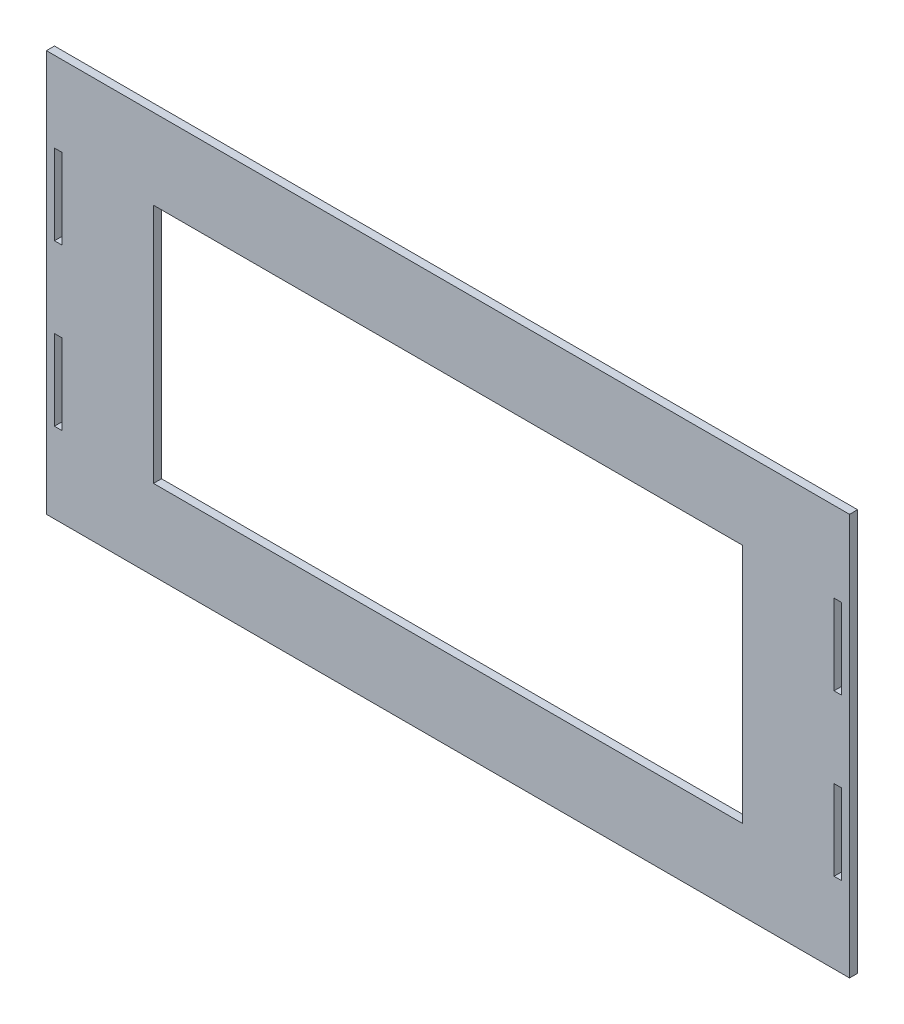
ISO-10303-21;
HEADER;
FILE_DESCRIPTION(('STEP AP214'),'2;1');
FILE_NAME('part.step','',(''),(''),'','','');
FILE_SCHEMA(('AUTOMOTIVE_DESIGN { 1 0 10303 214 1 1 1 1 }'));
ENDSEC;
DATA;
#1=APPLICATION_CONTEXT('core data for automotive mechanical design processes');
#2=APPLICATION_PROTOCOL_DEFINITION('international standard','automotive_design',2000,#1);
#3=PRODUCT_CONTEXT('',#1,'mechanical');
#4=PRODUCT('Part','Part','',(#3));
#5=PRODUCT_RELATED_PRODUCT_CATEGORY('part','',(#4));
#6=PRODUCT_DEFINITION_FORMATION('','',#4);
#7=PRODUCT_DEFINITION_CONTEXT('part definition',#1,'design');
#8=PRODUCT_DEFINITION('design','',#6,#7);
#9=PRODUCT_DEFINITION_SHAPE('','',#8);
#10=(LENGTH_UNIT() NAMED_UNIT(*) SI_UNIT(.MILLI.,.METRE.));
#11=(NAMED_UNIT(*) PLANE_ANGLE_UNIT() SI_UNIT($,.RADIAN.));
#12=(NAMED_UNIT(*) SI_UNIT($,.STERADIAN.) SOLID_ANGLE_UNIT());
#13=UNCERTAINTY_MEASURE_WITH_UNIT(LENGTH_MEASURE(1.E-05),#10,'distance_accuracy_value','');
#14=(GEOMETRIC_REPRESENTATION_CONTEXT(3) GLOBAL_UNCERTAINTY_ASSIGNED_CONTEXT((#13)) GLOBAL_UNIT_ASSIGNED_CONTEXT((#10,
#11,#12)) REPRESENTATION_CONTEXT('',''));
#15=CARTESIAN_POINT('',(0.,0.,0.));
#16=DIRECTION('',(0.,0.,1.));
#17=DIRECTION('',(1.,0.,0.));
#18=AXIS2_PLACEMENT_3D('',#15,#16,#17);
#19=CARTESIAN_POINT('',(0.,0.,3.));
#20=DIRECTION('',(0.,0.,-1.));
#21=DIRECTION('',(-1.,0.,0.));
#22=AXIS2_PLACEMENT_3D('',#19,#20,#21);
#23=PLANE('',#22);
#24=DIRECTION('',(0.,1.,0.));
#25=VECTOR('',#24,1.);
#26=CARTESIAN_POINT('',(147.,-15.,3.));
#27=LINE('',#26,#25);
#28=CARTESIAN_POINT('',(147.,-45.,3.));
#29=VERTEX_POINT('',#28);
#30=CARTESIAN_POINT('',(147.,-15.,3.));
#31=VERTEX_POINT('',#30);
#32=EDGE_CURVE('E230',#29,#31,#27,.T.);
#33=ORIENTED_EDGE('',*,*,#32,.F.);
#34=DIRECTION('',(1.,0.,0.));
#35=VECTOR('',#34,1.);
#36=CARTESIAN_POINT('',(147.,-45.,3.));
#37=LINE('',#36,#35);
#38=CARTESIAN_POINT('',(144.2,-45.,3.));
#39=VERTEX_POINT('',#38);
#40=EDGE_CURVE('E238',#39,#29,#37,.T.);
#41=ORIENTED_EDGE('',*,*,#40,.F.);
#42=DIRECTION('',(0.,-1.,0.));
#43=VECTOR('',#42,1.);
#44=CARTESIAN_POINT('',(144.2,-15.,3.));
#45=LINE('',#44,#43);
#46=CARTESIAN_POINT('',(144.2,-15.,3.));
#47=VERTEX_POINT('',#46);
#48=EDGE_CURVE('E235',#47,#39,#45,.T.);
#49=ORIENTED_EDGE('',*,*,#48,.F.);
#50=DIRECTION('',(-1.,0.,0.));
#51=VECTOR('',#50,1.);
#52=CARTESIAN_POINT('',(147.,-15.,3.));
#53=LINE('',#52,#51);
#54=EDGE_CURVE('E232',#31,#47,#53,.T.);
#55=ORIENTED_EDGE('',*,*,#54,.F.);
#56=EDGE_LOOP('',(#33,#41,#49,#55));
#57=FACE_BOUND('',#56,.T.);
#58=DIRECTION('',(0.,-1.,0.));
#59=VECTOR('',#58,1.);
#60=CARTESIAN_POINT('',(-147.,45.,3.));
#61=LINE('',#60,#59);
#62=CARTESIAN_POINT('',(-147.,45.,3.));
#63=VERTEX_POINT('',#62);
#64=CARTESIAN_POINT('',(-147.,15.,3.));
#65=VERTEX_POINT('',#64);
#66=EDGE_CURVE('E292',#63,#65,#61,.T.);
#67=ORIENTED_EDGE('',*,*,#66,.F.);
#68=DIRECTION('',(-1.,0.,0.));
#69=VECTOR('',#68,1.);
#70=CARTESIAN_POINT('',(-147.,45.,3.));
#71=LINE('',#70,#69);
#72=CARTESIAN_POINT('',(-144.2,45.,3.));
#73=VERTEX_POINT('',#72);
#74=EDGE_CURVE('E300',#73,#63,#71,.T.);
#75=ORIENTED_EDGE('',*,*,#74,.F.);
#76=DIRECTION('',(0.,1.,0.));
#77=VECTOR('',#76,1.);
#78=CARTESIAN_POINT('',(-144.2,45.,3.));
#79=LINE('',#78,#77);
#80=CARTESIAN_POINT('',(-144.2,15.,3.));
#81=VERTEX_POINT('',#80);
#82=EDGE_CURVE('E297',#81,#73,#79,.T.);
#83=ORIENTED_EDGE('',*,*,#82,.F.);
#84=DIRECTION('',(1.,0.,0.));
#85=VECTOR('',#84,1.);
#86=CARTESIAN_POINT('',(-147.,15.,3.));
#87=LINE('',#86,#85);
#88=EDGE_CURVE('E294',#65,#81,#87,.T.);
#89=ORIENTED_EDGE('',*,*,#88,.F.);
#90=EDGE_LOOP('',(#67,#75,#83,#89));
#91=FACE_BOUND('',#90,.T.);
#92=DIRECTION('',(0.,1.,0.));
#93=VECTOR('',#92,1.);
#94=CARTESIAN_POINT('',(150.,-75.,3.));
#95=LINE('',#94,#93);
#96=CARTESIAN_POINT('',(150.,-75.,3.));
#97=VERTEX_POINT('',#96);
#98=CARTESIAN_POINT('',(150.,75.,3.));
#99=VERTEX_POINT('',#98);
#100=EDGE_CURVE('E354',#97,#99,#95,.T.);
#101=ORIENTED_EDGE('',*,*,#100,.T.);
#102=DIRECTION('',(-1.,0.,0.));
#103=VECTOR('',#102,1.);
#104=CARTESIAN_POINT('',(-150.,75.,3.));
#105=LINE('',#104,#103);
#106=CARTESIAN_POINT('',(-150.,75.,3.));
#107=VERTEX_POINT('',#106);
#108=EDGE_CURVE('E357',#99,#107,#105,.T.);
#109=ORIENTED_EDGE('',*,*,#108,.T.);
#110=DIRECTION('',(0.,-1.,0.));
#111=VECTOR('',#110,1.);
#112=CARTESIAN_POINT('',(-150.,-75.,3.));
#113=LINE('',#112,#111);
#114=CARTESIAN_POINT('',(-150.,-75.,3.));
#115=VERTEX_POINT('',#114);
#116=EDGE_CURVE('E360',#107,#115,#113,.T.);
#117=ORIENTED_EDGE('',*,*,#116,.T.);
#118=DIRECTION('',(1.,0.,0.));
#119=VECTOR('',#118,1.);
#120=CARTESIAN_POINT('',(-150.,-75.,3.));
#121=LINE('',#120,#119);
#122=EDGE_CURVE('E362',#115,#97,#121,.T.);
#123=ORIENTED_EDGE('',*,*,#122,.T.);
#124=EDGE_LOOP('',(#101,#109,#117,#123));
#125=FACE_BOUND('',#124,.T.);
#126=DIRECTION('',(0.,1.,0.));
#127=VECTOR('',#126,1.);
#128=CARTESIAN_POINT('',(110.,-45.,3.));
#129=LINE('',#128,#127);
#130=CARTESIAN_POINT('',(110.,-45.,3.));
#131=VERTEX_POINT('',#130);
#132=CARTESIAN_POINT('',(110.,45.,3.));
#133=VERTEX_POINT('',#132);
#134=EDGE_CURVE('E323',#131,#133,#129,.T.);
#135=ORIENTED_EDGE('',*,*,#134,.F.);
#136=DIRECTION('',(1.,0.,0.));
#137=VECTOR('',#136,1.);
#138=CARTESIAN_POINT('',(-110.,-45.,3.));
#139=LINE('',#138,#137);
#140=CARTESIAN_POINT('',(-110.,-45.,3.));
#141=VERTEX_POINT('',#140);
#142=EDGE_CURVE('E331',#141,#131,#139,.T.);
#143=ORIENTED_EDGE('',*,*,#142,.F.);
#144=DIRECTION('',(0.,-1.,0.));
#145=VECTOR('',#144,1.);
#146=CARTESIAN_POINT('',(-110.,-45.,3.));
#147=LINE('',#146,#145);
#148=CARTESIAN_POINT('',(-110.,45.,3.));
#149=VERTEX_POINT('',#148);
#150=EDGE_CURVE('E328',#149,#141,#147,.T.);
#151=ORIENTED_EDGE('',*,*,#150,.F.);
#152=DIRECTION('',(-1.,0.,0.));
#153=VECTOR('',#152,1.);
#154=CARTESIAN_POINT('',(-110.,45.,3.));
#155=LINE('',#154,#153);
#156=EDGE_CURVE('E325',#133,#149,#155,.T.);
#157=ORIENTED_EDGE('',*,*,#156,.F.);
#158=EDGE_LOOP('',(#135,#143,#151,#157));
#159=FACE_BOUND('',#158,.T.);
#160=DIRECTION('',(0.,-1.,0.));
#161=VECTOR('',#160,1.);
#162=CARTESIAN_POINT('',(-147.,-15.,3.));
#163=LINE('',#162,#161);
#164=CARTESIAN_POINT('',(-147.,-15.,3.));
#165=VERTEX_POINT('',#164);
#166=CARTESIAN_POINT('',(-147.,-45.,3.));
#167=VERTEX_POINT('',#166);
#168=EDGE_CURVE('E261',#165,#167,#163,.T.);
#169=ORIENTED_EDGE('',*,*,#168,.F.);
#170=DIRECTION('',(-1.,0.,0.));
#171=VECTOR('',#170,1.);
#172=CARTESIAN_POINT('',(-147.,-15.,3.));
#173=LINE('',#172,#171);
#174=CARTESIAN_POINT('',(-144.2,-15.,3.));
#175=VERTEX_POINT('',#174);
#176=EDGE_CURVE('E269',#175,#165,#173,.T.);
#177=ORIENTED_EDGE('',*,*,#176,.F.);
#178=DIRECTION('',(0.,1.,0.));
#179=VECTOR('',#178,1.);
#180=CARTESIAN_POINT('',(-144.2,-15.,3.));
#181=LINE('',#180,#179);
#182=CARTESIAN_POINT('',(-144.2,-45.,3.));
#183=VERTEX_POINT('',#182);
#184=EDGE_CURVE('E266',#183,#175,#181,.T.);
#185=ORIENTED_EDGE('',*,*,#184,.F.);
#186=DIRECTION('',(1.,0.,0.));
#187=VECTOR('',#186,1.);
#188=CARTESIAN_POINT('',(-147.,-45.,3.));
#189=LINE('',#188,#187);
#190=EDGE_CURVE('E263',#167,#183,#189,.T.);
#191=ORIENTED_EDGE('',*,*,#190,.F.);
#192=EDGE_LOOP('',(#169,#177,#185,#191));
#193=FACE_BOUND('',#192,.T.);
#194=DIRECTION('',(0.,1.,0.));
#195=VECTOR('',#194,1.);
#196=CARTESIAN_POINT('',(147.,45.,3.));
#197=LINE('',#196,#195);
#198=CARTESIAN_POINT('',(147.,15.,3.));
#199=VERTEX_POINT('',#198);
#200=CARTESIAN_POINT('',(147.,45.,3.));
#201=VERTEX_POINT('',#200);
#202=EDGE_CURVE('E194',#199,#201,#197,.T.);
#203=ORIENTED_EDGE('',*,*,#202,.F.);
#204=DIRECTION('',(1.,0.,0.));
#205=VECTOR('',#204,1.);
#206=CARTESIAN_POINT('',(147.,15.,3.));
#207=LINE('',#206,#205);
#208=CARTESIAN_POINT('',(144.2,15.,3.));
#209=VERTEX_POINT('',#208);
#210=EDGE_CURVE('E216',#209,#199,#207,.T.);
#211=ORIENTED_EDGE('',*,*,#210,.F.);
#212=DIRECTION('',(0.,-1.,0.));
#213=VECTOR('',#212,1.);
#214=CARTESIAN_POINT('',(144.2,45.,3.));
#215=LINE('',#214,#213);
#216=CARTESIAN_POINT('',(144.2,45.,3.));
#217=VERTEX_POINT('',#216);
#218=EDGE_CURVE('E214',#217,#209,#215,.T.);
#219=ORIENTED_EDGE('',*,*,#218,.F.);
#220=DIRECTION('',(-1.,0.,0.));
#221=VECTOR('',#220,1.);
#222=CARTESIAN_POINT('',(147.,45.,3.));
#223=LINE('',#222,#221);
#224=EDGE_CURVE('E202',#201,#217,#223,.T.);
#225=ORIENTED_EDGE('',*,*,#224,.F.);
#226=EDGE_LOOP('',(#203,#211,#219,#225));
#227=FACE_BOUND('',#226,.T.);
#228=ADVANCED_FACE('F33',(#57,#91,#125,#159,#193,#227),#23,.F.);
#229=CARTESIAN_POINT('',(0.,0.,0.));
#230=DIRECTION('',(0.,0.,-1.));
#231=DIRECTION('',(-1.,0.,0.));
#232=AXIS2_PLACEMENT_3D('',#229,#230,#231);
#233=PLANE('',#232);
#234=DIRECTION('',(0.,1.,0.));
#235=VECTOR('',#234,1.);
#236=CARTESIAN_POINT('',(150.,-75.,0.));
#237=LINE('',#236,#235);
#238=CARTESIAN_POINT('',(150.,-75.,0.));
#239=VERTEX_POINT('',#238);
#240=CARTESIAN_POINT('',(150.,75.,0.));
#241=VERTEX_POINT('',#240);
#242=EDGE_CURVE('E353',#239,#241,#237,.T.);
#243=ORIENTED_EDGE('',*,*,#242,.F.);
#244=DIRECTION('',(1.,0.,0.));
#245=VECTOR('',#244,1.);
#246=CARTESIAN_POINT('',(-150.,-75.,0.));
#247=LINE('',#246,#245);
#248=CARTESIAN_POINT('',(-150.,-75.,0.));
#249=VERTEX_POINT('',#248);
#250=EDGE_CURVE('E358',#249,#239,#247,.T.);
#251=ORIENTED_EDGE('',*,*,#250,.F.);
#252=DIRECTION('',(0.,-1.,0.));
#253=VECTOR('',#252,1.);
#254=CARTESIAN_POINT('',(-150.,-75.,0.));
#255=LINE('',#254,#253);
#256=CARTESIAN_POINT('',(-150.,75.,0.));
#257=VERTEX_POINT('',#256);
#258=EDGE_CURVE('E369',#257,#249,#255,.T.);
#259=ORIENTED_EDGE('',*,*,#258,.F.);
#260=DIRECTION('',(-1.,0.,0.));
#261=VECTOR('',#260,1.);
#262=CARTESIAN_POINT('',(-150.,75.,0.));
#263=LINE('',#262,#261);
#264=EDGE_CURVE('E367',#241,#257,#263,.T.);
#265=ORIENTED_EDGE('',*,*,#264,.F.);
#266=EDGE_LOOP('',(#243,#251,#259,#265));
#267=FACE_BOUND('',#266,.T.);
#268=DIRECTION('',(1.,0.,0.));
#269=VECTOR('',#268,1.);
#270=CARTESIAN_POINT('',(-110.,-45.,0.));
#271=LINE('',#270,#269);
#272=CARTESIAN_POINT('',(-110.,-45.,0.));
#273=VERTEX_POINT('',#272);
#274=CARTESIAN_POINT('',(110.,-45.,0.));
#275=VERTEX_POINT('',#274);
#276=EDGE_CURVE('E326',#273,#275,#271,.T.);
#277=ORIENTED_EDGE('',*,*,#276,.T.);
#278=DIRECTION('',(0.,1.,0.));
#279=VECTOR('',#278,1.);
#280=CARTESIAN_POINT('',(110.,-45.,0.));
#281=LINE('',#280,#279);
#282=CARTESIAN_POINT('',(110.,45.,0.));
#283=VERTEX_POINT('',#282);
#284=EDGE_CURVE('E322',#275,#283,#281,.T.);
#285=ORIENTED_EDGE('',*,*,#284,.T.);
#286=DIRECTION('',(-1.,0.,0.));
#287=VECTOR('',#286,1.);
#288=CARTESIAN_POINT('',(-110.,45.,0.));
#289=LINE('',#288,#287);
#290=CARTESIAN_POINT('',(-110.,45.,0.));
#291=VERTEX_POINT('',#290);
#292=EDGE_CURVE('E336',#283,#291,#289,.T.);
#293=ORIENTED_EDGE('',*,*,#292,.T.);
#294=DIRECTION('',(0.,-1.,0.));
#295=VECTOR('',#294,1.);
#296=CARTESIAN_POINT('',(-110.,-45.,0.));
#297=LINE('',#296,#295);
#298=EDGE_CURVE('E339',#291,#273,#297,.T.);
#299=ORIENTED_EDGE('',*,*,#298,.T.);
#300=EDGE_LOOP('',(#277,#285,#293,#299));
#301=FACE_BOUND('',#300,.T.);
#302=DIRECTION('',(-1.,0.,0.));
#303=VECTOR('',#302,1.);
#304=CARTESIAN_POINT('',(-147.,45.,0.));
#305=LINE('',#304,#303);
#306=CARTESIAN_POINT('',(-144.2,45.,0.));
#307=VERTEX_POINT('',#306);
#308=CARTESIAN_POINT('',(-147.,45.,0.));
#309=VERTEX_POINT('',#308);
#310=EDGE_CURVE('E295',#307,#309,#305,.T.);
#311=ORIENTED_EDGE('',*,*,#310,.T.);
#312=DIRECTION('',(0.,-1.,0.));
#313=VECTOR('',#312,1.);
#314=CARTESIAN_POINT('',(-147.,45.,0.));
#315=LINE('',#314,#313);
#316=CARTESIAN_POINT('',(-147.,15.,0.));
#317=VERTEX_POINT('',#316);
#318=EDGE_CURVE('E291',#309,#317,#315,.T.);
#319=ORIENTED_EDGE('',*,*,#318,.T.);
#320=DIRECTION('',(1.,0.,0.));
#321=VECTOR('',#320,1.);
#322=CARTESIAN_POINT('',(-147.,15.,0.));
#323=LINE('',#322,#321);
#324=CARTESIAN_POINT('',(-144.2,15.,0.));
#325=VERTEX_POINT('',#324);
#326=EDGE_CURVE('E305',#317,#325,#323,.T.);
#327=ORIENTED_EDGE('',*,*,#326,.T.);
#328=DIRECTION('',(0.,1.,0.));
#329=VECTOR('',#328,1.);
#330=CARTESIAN_POINT('',(-144.2,45.,0.));
#331=LINE('',#330,#329);
#332=EDGE_CURVE('E308',#325,#307,#331,.T.);
#333=ORIENTED_EDGE('',*,*,#332,.T.);
#334=EDGE_LOOP('',(#311,#319,#327,#333));
#335=FACE_BOUND('',#334,.T.);
#336=DIRECTION('',(-1.,0.,0.));
#337=VECTOR('',#336,1.);
#338=CARTESIAN_POINT('',(-147.,-15.,0.));
#339=LINE('',#338,#337);
#340=CARTESIAN_POINT('',(-144.2,-15.,0.));
#341=VERTEX_POINT('',#340);
#342=CARTESIAN_POINT('',(-147.,-15.,0.));
#343=VERTEX_POINT('',#342);
#344=EDGE_CURVE('E264',#341,#343,#339,.T.);
#345=ORIENTED_EDGE('',*,*,#344,.T.);
#346=DIRECTION('',(0.,-1.,0.));
#347=VECTOR('',#346,1.);
#348=CARTESIAN_POINT('',(-147.,-15.,0.));
#349=LINE('',#348,#347);
#350=CARTESIAN_POINT('',(-147.,-45.,0.));
#351=VERTEX_POINT('',#350);
#352=EDGE_CURVE('E260',#343,#351,#349,.T.);
#353=ORIENTED_EDGE('',*,*,#352,.T.);
#354=DIRECTION('',(1.,0.,0.));
#355=VECTOR('',#354,1.);
#356=CARTESIAN_POINT('',(-147.,-45.,0.));
#357=LINE('',#356,#355);
#358=CARTESIAN_POINT('',(-144.2,-45.,0.));
#359=VERTEX_POINT('',#358);
#360=EDGE_CURVE('E274',#351,#359,#357,.T.);
#361=ORIENTED_EDGE('',*,*,#360,.T.);
#362=DIRECTION('',(0.,1.,0.));
#363=VECTOR('',#362,1.);
#364=CARTESIAN_POINT('',(-144.2,-15.,0.));
#365=LINE('',#364,#363);
#366=EDGE_CURVE('E277',#359,#341,#365,.T.);
#367=ORIENTED_EDGE('',*,*,#366,.T.);
#368=EDGE_LOOP('',(#345,#353,#361,#367));
#369=FACE_BOUND('',#368,.T.);
#370=DIRECTION('',(1.,0.,0.));
#371=VECTOR('',#370,1.);
#372=CARTESIAN_POINT('',(147.,-45.,0.));
#373=LINE('',#372,#371);
#374=CARTESIAN_POINT('',(144.2,-45.,0.));
#375=VERTEX_POINT('',#374);
#376=CARTESIAN_POINT('',(147.,-45.,0.));
#377=VERTEX_POINT('',#376);
#378=EDGE_CURVE('E233',#375,#377,#373,.T.);
#379=ORIENTED_EDGE('',*,*,#378,.T.);
#380=DIRECTION('',(0.,1.,0.));
#381=VECTOR('',#380,1.);
#382=CARTESIAN_POINT('',(147.,-15.,0.));
#383=LINE('',#382,#381);
#384=CARTESIAN_POINT('',(147.,-15.,0.));
#385=VERTEX_POINT('',#384);
#386=EDGE_CURVE('E210',#377,#385,#383,.T.);
#387=ORIENTED_EDGE('',*,*,#386,.T.);
#388=DIRECTION('',(-1.,0.,0.));
#389=VECTOR('',#388,1.);
#390=CARTESIAN_POINT('',(147.,-15.,0.));
#391=LINE('',#390,#389);
#392=CARTESIAN_POINT('',(144.2,-15.,0.));
#393=VERTEX_POINT('',#392);
#394=EDGE_CURVE('E243',#385,#393,#391,.T.);
#395=ORIENTED_EDGE('',*,*,#394,.T.);
#396=DIRECTION('',(0.,-1.,0.));
#397=VECTOR('',#396,1.);
#398=CARTESIAN_POINT('',(144.2,-15.,0.));
#399=LINE('',#398,#397);
#400=EDGE_CURVE('E246',#393,#375,#399,.T.);
#401=ORIENTED_EDGE('',*,*,#400,.T.);
#402=EDGE_LOOP('',(#379,#387,#395,#401));
#403=FACE_BOUND('',#402,.T.);
#404=DIRECTION('',(1.,0.,0.));
#405=VECTOR('',#404,1.);
#406=CARTESIAN_POINT('',(147.,15.,0.));
#407=LINE('',#406,#405);
#408=CARTESIAN_POINT('',(144.2,15.,0.));
#409=VERTEX_POINT('',#408);
#410=CARTESIAN_POINT('',(147.,15.,0.));
#411=VERTEX_POINT('',#410);
#412=EDGE_CURVE('E203',#409,#411,#407,.T.);
#413=ORIENTED_EDGE('',*,*,#412,.T.);
#414=DIRECTION('',(0.,1.,0.));
#415=VECTOR('',#414,1.);
#416=CARTESIAN_POINT('',(147.,45.,0.));
#417=LINE('',#416,#415);
#418=CARTESIAN_POINT('',(147.,45.,0.));
#419=VERTEX_POINT('',#418);
#420=EDGE_CURVE('E56',#411,#419,#417,.T.);
#421=ORIENTED_EDGE('',*,*,#420,.T.);
#422=DIRECTION('',(-1.,0.,0.));
#423=VECTOR('',#422,1.);
#424=CARTESIAN_POINT('',(147.,45.,0.));
#425=LINE('',#424,#423);
#426=CARTESIAN_POINT('',(144.2,45.,0.));
#427=VERTEX_POINT('',#426);
#428=EDGE_CURVE('E209',#419,#427,#425,.T.);
#429=ORIENTED_EDGE('',*,*,#428,.T.);
#430=DIRECTION('',(0.,-1.,0.));
#431=VECTOR('',#430,1.);
#432=CARTESIAN_POINT('',(144.2,45.,0.));
#433=LINE('',#432,#431);
#434=EDGE_CURVE('E222',#427,#409,#433,.T.);
#435=ORIENTED_EDGE('',*,*,#434,.T.);
#436=EDGE_LOOP('',(#413,#421,#429,#435));
#437=FACE_BOUND('',#436,.T.);
#438=ADVANCED_FACE('F387',(#267,#301,#335,#369,#403,#437),#233,.T.);
#439=CARTESIAN_POINT('',(150.,-75.,3.));
#440=DIRECTION('',(-1.,0.,0.));
#441=DIRECTION('',(0.,0.,1.));
#442=AXIS2_PLACEMENT_3D('',#439,#440,#441);
#443=PLANE('',#442);
#444=ORIENTED_EDGE('',*,*,#242,.T.);
#445=DIRECTION('',(0.,0.,-1.));
#446=VECTOR('',#445,1.);
#447=CARTESIAN_POINT('',(150.,75.,3.));
#448=LINE('',#447,#446);
#449=EDGE_CURVE('E11',#99,#241,#448,.T.);
#450=ORIENTED_EDGE('',*,*,#449,.F.);
#451=ORIENTED_EDGE('',*,*,#100,.F.);
#452=DIRECTION('',(0.,0.,-1.));
#453=VECTOR('',#452,1.);
#454=CARTESIAN_POINT('',(150.,-75.,3.));
#455=LINE('',#454,#453);
#456=EDGE_CURVE('E364',#97,#239,#455,.T.);
#457=ORIENTED_EDGE('',*,*,#456,.T.);
#458=EDGE_LOOP('',(#444,#450,#451,#457));
#459=FACE_BOUND('',#458,.T.);
#460=ADVANCED_FACE('F35',(#459),#443,.F.);
#461=CARTESIAN_POINT('',(-150.,75.,3.));
#462=DIRECTION('',(0.,-1.,0.));
#463=DIRECTION('',(0.,0.,-1.));
#464=AXIS2_PLACEMENT_3D('',#461,#462,#463);
#465=PLANE('',#464);
#466=ORIENTED_EDGE('',*,*,#264,.T.);
#467=DIRECTION('',(0.,0.,-1.));
#468=VECTOR('',#467,1.);
#469=CARTESIAN_POINT('',(-150.,75.,3.));
#470=LINE('',#469,#468);
#471=EDGE_CURVE('E41',#107,#257,#470,.T.);
#472=ORIENTED_EDGE('',*,*,#471,.F.);
#473=ORIENTED_EDGE('',*,*,#108,.F.);
#474=ORIENTED_EDGE('',*,*,#449,.T.);
#475=EDGE_LOOP('',(#466,#472,#473,#474));
#476=FACE_BOUND('',#475,.T.);
#477=ADVANCED_FACE('F398',(#476),#465,.F.);
#478=CARTESIAN_POINT('',(-150.,-75.,3.));
#479=DIRECTION('',(1.,0.,0.));
#480=DIRECTION('',(0.,0.,-1.));
#481=AXIS2_PLACEMENT_3D('',#478,#479,#480);
#482=PLANE('',#481);
#483=ORIENTED_EDGE('',*,*,#258,.T.);
#484=DIRECTION('',(0.,0.,-1.));
#485=VECTOR('',#484,1.);
#486=CARTESIAN_POINT('',(-150.,-75.,3.));
#487=LINE('',#486,#485);
#488=EDGE_CURVE('E374',#115,#249,#487,.T.);
#489=ORIENTED_EDGE('',*,*,#488,.F.);
#490=ORIENTED_EDGE('',*,*,#116,.F.);
#491=ORIENTED_EDGE('',*,*,#471,.T.);
#492=EDGE_LOOP('',(#483,#489,#490,#491));
#493=FACE_BOUND('',#492,.T.);
#494=ADVANCED_FACE('F381',(#493),#482,.F.);
#495=CARTESIAN_POINT('',(-150.,-75.,3.));
#496=DIRECTION('',(0.,1.,0.));
#497=DIRECTION('',(0.,0.,1.));
#498=AXIS2_PLACEMENT_3D('',#495,#496,#497);
#499=PLANE('',#498);
#500=ORIENTED_EDGE('',*,*,#250,.T.);
#501=ORIENTED_EDGE('',*,*,#456,.F.);
#502=ORIENTED_EDGE('',*,*,#122,.F.);
#503=ORIENTED_EDGE('',*,*,#488,.T.);
#504=EDGE_LOOP('',(#500,#501,#502,#503));
#505=FACE_BOUND('',#504,.T.);
#506=ADVANCED_FACE('F391',(#505),#499,.F.);
#507=CARTESIAN_POINT('',(110.,-45.,3.));
#508=DIRECTION('',(-1.,0.,0.));
#509=DIRECTION('',(0.,0.,1.));
#510=AXIS2_PLACEMENT_3D('',#507,#508,#509);
#511=PLANE('',#510);
#512=ORIENTED_EDGE('',*,*,#284,.F.);
#513=DIRECTION('',(0.,0.,-1.));
#514=VECTOR('',#513,1.);
#515=CARTESIAN_POINT('',(110.,-45.,3.));
#516=LINE('',#515,#514);
#517=EDGE_CURVE('E333',#131,#275,#516,.T.);
#518=ORIENTED_EDGE('',*,*,#517,.F.);
#519=ORIENTED_EDGE('',*,*,#134,.T.);
#520=DIRECTION('',(0.,0.,-1.));
#521=VECTOR('',#520,1.);
#522=CARTESIAN_POINT('',(110.,45.,3.));
#523=LINE('',#522,#521);
#524=EDGE_CURVE('E350',#133,#283,#523,.T.);
#525=ORIENTED_EDGE('',*,*,#524,.T.);
#526=EDGE_LOOP('',(#512,#518,#519,#525));
#527=FACE_BOUND('',#526,.T.);
#528=ADVANCED_FACE('F415',(#527),#511,.T.);
#529=CARTESIAN_POINT('',(-110.,45.,3.));
#530=DIRECTION('',(0.,-1.,0.));
#531=DIRECTION('',(0.,0.,-1.));
#532=AXIS2_PLACEMENT_3D('',#529,#530,#531);
#533=PLANE('',#532);
#534=ORIENTED_EDGE('',*,*,#292,.F.);
#535=ORIENTED_EDGE('',*,*,#524,.F.);
#536=ORIENTED_EDGE('',*,*,#156,.T.);
#537=DIRECTION('',(0.,0.,-1.));
#538=VECTOR('',#537,1.);
#539=CARTESIAN_POINT('',(-110.,45.,3.));
#540=LINE('',#539,#538);
#541=EDGE_CURVE('E348',#149,#291,#540,.T.);
#542=ORIENTED_EDGE('',*,*,#541,.T.);
#543=EDGE_LOOP('',(#534,#535,#536,#542));
#544=FACE_BOUND('',#543,.T.);
#545=ADVANCED_FACE('F422',(#544),#533,.T.);
#546=CARTESIAN_POINT('',(-110.,-45.,3.));
#547=DIRECTION('',(1.,0.,0.));
#548=DIRECTION('',(0.,0.,-1.));
#549=AXIS2_PLACEMENT_3D('',#546,#547,#548);
#550=PLANE('',#549);
#551=ORIENTED_EDGE('',*,*,#298,.F.);
#552=ORIENTED_EDGE('',*,*,#541,.F.);
#553=ORIENTED_EDGE('',*,*,#150,.T.);
#554=DIRECTION('',(0.,0.,-1.));
#555=VECTOR('',#554,1.);
#556=CARTESIAN_POINT('',(-110.,-45.,3.));
#557=LINE('',#556,#555);
#558=EDGE_CURVE('E346',#141,#273,#557,.T.);
#559=ORIENTED_EDGE('',*,*,#558,.T.);
#560=EDGE_LOOP('',(#551,#552,#553,#559));
#561=FACE_BOUND('',#560,.T.);
#562=ADVANCED_FACE('F427',(#561),#550,.T.);
#563=CARTESIAN_POINT('',(-110.,-45.,3.));
#564=DIRECTION('',(0.,1.,0.));
#565=DIRECTION('',(0.,0.,1.));
#566=AXIS2_PLACEMENT_3D('',#563,#564,#565);
#567=PLANE('',#566);
#568=ORIENTED_EDGE('',*,*,#276,.F.);
#569=ORIENTED_EDGE('',*,*,#558,.F.);
#570=ORIENTED_EDGE('',*,*,#142,.T.);
#571=ORIENTED_EDGE('',*,*,#517,.T.);
#572=EDGE_LOOP('',(#568,#569,#570,#571));
#573=FACE_BOUND('',#572,.T.);
#574=ADVANCED_FACE('F434',(#573),#567,.T.);
#575=CARTESIAN_POINT('',(-147.,45.,3.));
#576=DIRECTION('',(1.,0.,0.));
#577=DIRECTION('',(0.,0.,-1.));
#578=AXIS2_PLACEMENT_3D('',#575,#576,#577);
#579=PLANE('',#578);
#580=ORIENTED_EDGE('',*,*,#318,.F.);
#581=DIRECTION('',(0.,0.,-1.));
#582=VECTOR('',#581,1.);
#583=CARTESIAN_POINT('',(-147.,45.,3.));
#584=LINE('',#583,#582);
#585=EDGE_CURVE('E302',#63,#309,#584,.T.);
#586=ORIENTED_EDGE('',*,*,#585,.F.);
#587=ORIENTED_EDGE('',*,*,#66,.T.);
#588=DIRECTION('',(0.,0.,-1.));
#589=VECTOR('',#588,1.);
#590=CARTESIAN_POINT('',(-147.,15.,3.));
#591=LINE('',#590,#589);
#592=EDGE_CURVE('E319',#65,#317,#591,.T.);
#593=ORIENTED_EDGE('',*,*,#592,.T.);
#594=EDGE_LOOP('',(#580,#586,#587,#593));
#595=FACE_BOUND('',#594,.T.);
#596=ADVANCED_FACE('F486',(#595),#579,.T.);
#597=CARTESIAN_POINT('',(-147.,15.,3.));
#598=DIRECTION('',(0.,1.,0.));
#599=DIRECTION('',(0.,0.,1.));
#600=AXIS2_PLACEMENT_3D('',#597,#598,#599);
#601=PLANE('',#600);
#602=ORIENTED_EDGE('',*,*,#326,.F.);
#603=ORIENTED_EDGE('',*,*,#592,.F.);
#604=ORIENTED_EDGE('',*,*,#88,.T.);
#605=DIRECTION('',(0.,0.,-1.));
#606=VECTOR('',#605,1.);
#607=CARTESIAN_POINT('',(-144.2,15.,3.));
#608=LINE('',#607,#606);
#609=EDGE_CURVE('E317',#81,#325,#608,.T.);
#610=ORIENTED_EDGE('',*,*,#609,.T.);
#611=EDGE_LOOP('',(#602,#603,#604,#610));
#612=FACE_BOUND('',#611,.T.);
#613=ADVANCED_FACE('F482',(#612),#601,.T.);
#614=CARTESIAN_POINT('',(-144.2,45.,3.));
#615=DIRECTION('',(-1.,0.,0.));
#616=DIRECTION('',(0.,0.,1.));
#617=AXIS2_PLACEMENT_3D('',#614,#615,#616);
#618=PLANE('',#617);
#619=ORIENTED_EDGE('',*,*,#332,.F.);
#620=ORIENTED_EDGE('',*,*,#609,.F.);
#621=ORIENTED_EDGE('',*,*,#82,.T.);
#622=DIRECTION('',(0.,0.,-1.));
#623=VECTOR('',#622,1.);
#624=CARTESIAN_POINT('',(-144.2,45.,3.));
#625=LINE('',#624,#623);
#626=EDGE_CURVE('E315',#73,#307,#625,.T.);
#627=ORIENTED_EDGE('',*,*,#626,.T.);
#628=EDGE_LOOP('',(#619,#620,#621,#627));
#629=FACE_BOUND('',#628,.T.);
#630=ADVANCED_FACE('F478',(#629),#618,.T.);
#631=CARTESIAN_POINT('',(-147.,45.,3.));
#632=DIRECTION('',(0.,-1.,0.));
#633=DIRECTION('',(1.,0.,0.));
#634=AXIS2_PLACEMENT_3D('',#631,#632,#633);
#635=PLANE('',#634);
#636=ORIENTED_EDGE('',*,*,#310,.F.);
#637=ORIENTED_EDGE('',*,*,#626,.F.);
#638=ORIENTED_EDGE('',*,*,#74,.T.);
#639=ORIENTED_EDGE('',*,*,#585,.T.);
#640=EDGE_LOOP('',(#636,#637,#638,#639));
#641=FACE_BOUND('',#640,.T.);
#642=ADVANCED_FACE('F475',(#641),#635,.T.);
#643=CARTESIAN_POINT('',(-147.,-15.,3.));
#644=DIRECTION('',(1.,0.,0.));
#645=DIRECTION('',(0.,1.,0.));
#646=AXIS2_PLACEMENT_3D('',#643,#644,#645);
#647=PLANE('',#646);
#648=ORIENTED_EDGE('',*,*,#352,.F.);
#649=DIRECTION('',(0.,0.,-1.));
#650=VECTOR('',#649,1.);
#651=CARTESIAN_POINT('',(-147.,-15.,3.));
#652=LINE('',#651,#650);
#653=EDGE_CURVE('E271',#165,#343,#652,.T.);
#654=ORIENTED_EDGE('',*,*,#653,.F.);
#655=ORIENTED_EDGE('',*,*,#168,.T.);
#656=DIRECTION('',(0.,0.,-1.));
#657=VECTOR('',#656,1.);
#658=CARTESIAN_POINT('',(-147.,-45.,3.));
#659=LINE('',#658,#657);
#660=EDGE_CURVE('E288',#167,#351,#659,.T.);
#661=ORIENTED_EDGE('',*,*,#660,.T.);
#662=EDGE_LOOP('',(#648,#654,#655,#661));
#663=FACE_BOUND('',#662,.T.);
#664=ADVANCED_FACE('F450',(#663),#647,.T.);
#665=CARTESIAN_POINT('',(-147.,-45.,3.));
#666=DIRECTION('',(0.,1.,0.));
#667=DIRECTION('',(0.,0.,1.));
#668=AXIS2_PLACEMENT_3D('',#665,#666,#667);
#669=PLANE('',#668);
#670=ORIENTED_EDGE('',*,*,#360,.F.);
#671=ORIENTED_EDGE('',*,*,#660,.F.);
#672=ORIENTED_EDGE('',*,*,#190,.T.);
#673=DIRECTION('',(0.,0.,-1.));
#674=VECTOR('',#673,1.);
#675=CARTESIAN_POINT('',(-144.2,-45.,3.));
#676=LINE('',#675,#674);
#677=EDGE_CURVE('E286',#183,#359,#676,.T.);
#678=ORIENTED_EDGE('',*,*,#677,.T.);
#679=EDGE_LOOP('',(#670,#671,#672,#678));
#680=FACE_BOUND('',#679,.T.);
#681=ADVANCED_FACE('F452',(#680),#669,.T.);
#682=CARTESIAN_POINT('',(-144.2,-15.,3.));
#683=DIRECTION('',(-1.,0.,0.));
#684=DIRECTION('',(0.,0.,1.));
#685=AXIS2_PLACEMENT_3D('',#682,#683,#684);
#686=PLANE('',#685);
#687=ORIENTED_EDGE('',*,*,#366,.F.);
#688=ORIENTED_EDGE('',*,*,#677,.F.);
#689=ORIENTED_EDGE('',*,*,#184,.T.);
#690=DIRECTION('',(0.,0.,-1.));
#691=VECTOR('',#690,1.);
#692=CARTESIAN_POINT('',(-144.2,-15.,3.));
#693=LINE('',#692,#691);
#694=EDGE_CURVE('E284',#175,#341,#693,.T.);
#695=ORIENTED_EDGE('',*,*,#694,.T.);
#696=EDGE_LOOP('',(#687,#688,#689,#695));
#697=FACE_BOUND('',#696,.T.);
#698=ADVANCED_FACE('F461',(#697),#686,.T.);
#699=CARTESIAN_POINT('',(-147.,-15.,3.));
#700=DIRECTION('',(0.,-1.,0.));
#701=DIRECTION('',(0.,0.,-1.));
#702=AXIS2_PLACEMENT_3D('',#699,#700,#701);
#703=PLANE('',#702);
#704=ORIENTED_EDGE('',*,*,#344,.F.);
#705=ORIENTED_EDGE('',*,*,#694,.F.);
#706=ORIENTED_EDGE('',*,*,#176,.T.);
#707=ORIENTED_EDGE('',*,*,#653,.T.);
#708=EDGE_LOOP('',(#704,#705,#706,#707));
#709=FACE_BOUND('',#708,.T.);
#710=ADVANCED_FACE('F459',(#709),#703,.T.);
#711=CARTESIAN_POINT('',(147.,-15.,3.));
#712=DIRECTION('',(-1.,0.,0.));
#713=DIRECTION('',(0.,-1.,0.));
#714=AXIS2_PLACEMENT_3D('',#711,#712,#713);
#715=PLANE('',#714);
#716=ORIENTED_EDGE('',*,*,#386,.F.);
#717=DIRECTION('',(0.,0.,-1.));
#718=VECTOR('',#717,1.);
#719=CARTESIAN_POINT('',(147.,-45.,3.));
#720=LINE('',#719,#718);
#721=EDGE_CURVE('E240',#29,#377,#720,.T.);
#722=ORIENTED_EDGE('',*,*,#721,.F.);
#723=ORIENTED_EDGE('',*,*,#32,.T.);
#724=DIRECTION('',(0.,0.,-1.));
#725=VECTOR('',#724,1.);
#726=CARTESIAN_POINT('',(147.,-15.,3.));
#727=LINE('',#726,#725);
#728=EDGE_CURVE('E257',#31,#385,#727,.T.);
#729=ORIENTED_EDGE('',*,*,#728,.T.);
#730=EDGE_LOOP('',(#716,#722,#723,#729));
#731=FACE_BOUND('',#730,.T.);
#732=ADVANCED_FACE('F468',(#731),#715,.T.);
#733=CARTESIAN_POINT('',(147.,-15.,3.));
#734=DIRECTION('',(0.,-1.,0.));
#735=DIRECTION('',(0.,0.,-1.));
#736=AXIS2_PLACEMENT_3D('',#733,#734,#735);
#737=PLANE('',#736);
#738=ORIENTED_EDGE('',*,*,#394,.F.);
#739=ORIENTED_EDGE('',*,*,#728,.F.);
#740=ORIENTED_EDGE('',*,*,#54,.T.);
#741=DIRECTION('',(0.,0.,-1.));
#742=VECTOR('',#741,1.);
#743=CARTESIAN_POINT('',(144.2,-15.,3.));
#744=LINE('',#743,#742);
#745=EDGE_CURVE('E255',#47,#393,#744,.T.);
#746=ORIENTED_EDGE('',*,*,#745,.T.);
#747=EDGE_LOOP('',(#738,#739,#740,#746));
#748=FACE_BOUND('',#747,.T.);
#749=ADVANCED_FACE('F545',(#748),#737,.T.);
#750=CARTESIAN_POINT('',(144.2,-15.,3.));
#751=DIRECTION('',(1.,0.,0.));
#752=DIRECTION('',(0.,0.,-1.));
#753=AXIS2_PLACEMENT_3D('',#750,#751,#752);
#754=PLANE('',#753);
#755=ORIENTED_EDGE('',*,*,#400,.F.);
#756=ORIENTED_EDGE('',*,*,#745,.F.);
#757=ORIENTED_EDGE('',*,*,#48,.T.);
#758=DIRECTION('',(0.,0.,-1.));
#759=VECTOR('',#758,1.);
#760=CARTESIAN_POINT('',(144.2,-45.,3.));
#761=LINE('',#760,#759);
#762=EDGE_CURVE('E253',#39,#375,#761,.T.);
#763=ORIENTED_EDGE('',*,*,#762,.T.);
#764=EDGE_LOOP('',(#755,#756,#757,#763));
#765=FACE_BOUND('',#764,.T.);
#766=ADVANCED_FACE('F554',(#765),#754,.T.);
#767=CARTESIAN_POINT('',(147.,-45.,3.));
#768=DIRECTION('',(0.,1.,0.));
#769=DIRECTION('',(0.,0.,1.));
#770=AXIS2_PLACEMENT_3D('',#767,#768,#769);
#771=PLANE('',#770);
#772=ORIENTED_EDGE('',*,*,#378,.F.);
#773=ORIENTED_EDGE('',*,*,#762,.F.);
#774=ORIENTED_EDGE('',*,*,#40,.T.);
#775=ORIENTED_EDGE('',*,*,#721,.T.);
#776=EDGE_LOOP('',(#772,#773,#774,#775));
#777=FACE_BOUND('',#776,.T.);
#778=ADVANCED_FACE('F564',(#777),#771,.T.);
#779=CARTESIAN_POINT('',(147.,45.,3.));
#780=DIRECTION('',(-1.,0.,0.));
#781=DIRECTION('',(0.,0.,1.));
#782=AXIS2_PLACEMENT_3D('',#779,#780,#781);
#783=PLANE('',#782);
#784=ORIENTED_EDGE('',*,*,#420,.F.);
#785=DIRECTION('',(0.,0.,-1.));
#786=VECTOR('',#785,1.);
#787=CARTESIAN_POINT('',(147.,15.,3.));
#788=LINE('',#787,#786);
#789=EDGE_CURVE('E198',#199,#411,#788,.T.);
#790=ORIENTED_EDGE('',*,*,#789,.F.);
#791=ORIENTED_EDGE('',*,*,#202,.T.);
#792=DIRECTION('',(0.,0.,-1.));
#793=VECTOR('',#792,1.);
#794=CARTESIAN_POINT('',(147.,45.,3.));
#795=LINE('',#794,#793);
#796=EDGE_CURVE('E197',#201,#419,#795,.T.);
#797=ORIENTED_EDGE('',*,*,#796,.T.);
#798=EDGE_LOOP('',(#784,#790,#791,#797));
#799=FACE_BOUND('',#798,.T.);
#800=ADVANCED_FACE('F196',(#799),#783,.T.);
#801=CARTESIAN_POINT('',(147.,45.,3.));
#802=DIRECTION('',(0.,-1.,0.));
#803=DIRECTION('',(1.,0.,0.));
#804=AXIS2_PLACEMENT_3D('',#801,#802,#803);
#805=PLANE('',#804);
#806=ORIENTED_EDGE('',*,*,#428,.F.);
#807=ORIENTED_EDGE('',*,*,#796,.F.);
#808=ORIENTED_EDGE('',*,*,#224,.T.);
#809=DIRECTION('',(0.,0.,-1.));
#810=VECTOR('',#809,1.);
#811=CARTESIAN_POINT('',(144.2,45.,3.));
#812=LINE('',#811,#810);
#813=EDGE_CURVE('E211',#217,#427,#812,.T.);
#814=ORIENTED_EDGE('',*,*,#813,.T.);
#815=EDGE_LOOP('',(#806,#807,#808,#814));
#816=FACE_BOUND('',#815,.T.);
#817=ADVANCED_FACE('F206',(#816),#805,.T.);
#818=CARTESIAN_POINT('',(144.2,45.,3.));
#819=DIRECTION('',(1.,0.,0.));
#820=DIRECTION('',(0.,0.,-1.));
#821=AXIS2_PLACEMENT_3D('',#818,#819,#820);
#822=PLANE('',#821);
#823=ORIENTED_EDGE('',*,*,#434,.F.);
#824=ORIENTED_EDGE('',*,*,#813,.F.);
#825=ORIENTED_EDGE('',*,*,#218,.T.);
#826=DIRECTION('',(0.,0.,-1.));
#827=VECTOR('',#826,1.);
#828=CARTESIAN_POINT('',(144.2,15.,3.));
#829=LINE('',#828,#827);
#830=EDGE_CURVE('E48',#209,#409,#829,.T.);
#831=ORIENTED_EDGE('',*,*,#830,.T.);
#832=EDGE_LOOP('',(#823,#824,#825,#831));
#833=FACE_BOUND('',#832,.T.);
#834=ADVANCED_FACE('F591',(#833),#822,.T.);
#835=CARTESIAN_POINT('',(147.,15.,3.));
#836=DIRECTION('',(0.,1.,0.));
#837=DIRECTION('',(0.,0.,1.));
#838=AXIS2_PLACEMENT_3D('',#835,#836,#837);
#839=PLANE('',#838);
#840=ORIENTED_EDGE('',*,*,#412,.F.);
#841=ORIENTED_EDGE('',*,*,#830,.F.);
#842=ORIENTED_EDGE('',*,*,#210,.T.);
#843=ORIENTED_EDGE('',*,*,#789,.T.);
#844=EDGE_LOOP('',(#840,#841,#842,#843));
#845=FACE_BOUND('',#844,.T.);
#846=ADVANCED_FACE('F600',(#845),#839,.T.);
#847=CLOSED_SHELL('',(#228,#438,#460,#477,#494,#506,#528,#545,#562,#574,#596,#613,#630,#642,
#664,#681,#698,#710,#732,#749,#766,#778,#800,#817,#834,#846));
#848=MANIFOLD_SOLID_BREP('B2',#847);
#849=ADVANCED_BREP_SHAPE_REPRESENTATION('',(#18,#848),#14);
#850=SHAPE_DEFINITION_REPRESENTATION(#9,#849);
ENDSEC;
END-ISO-10303-21;
